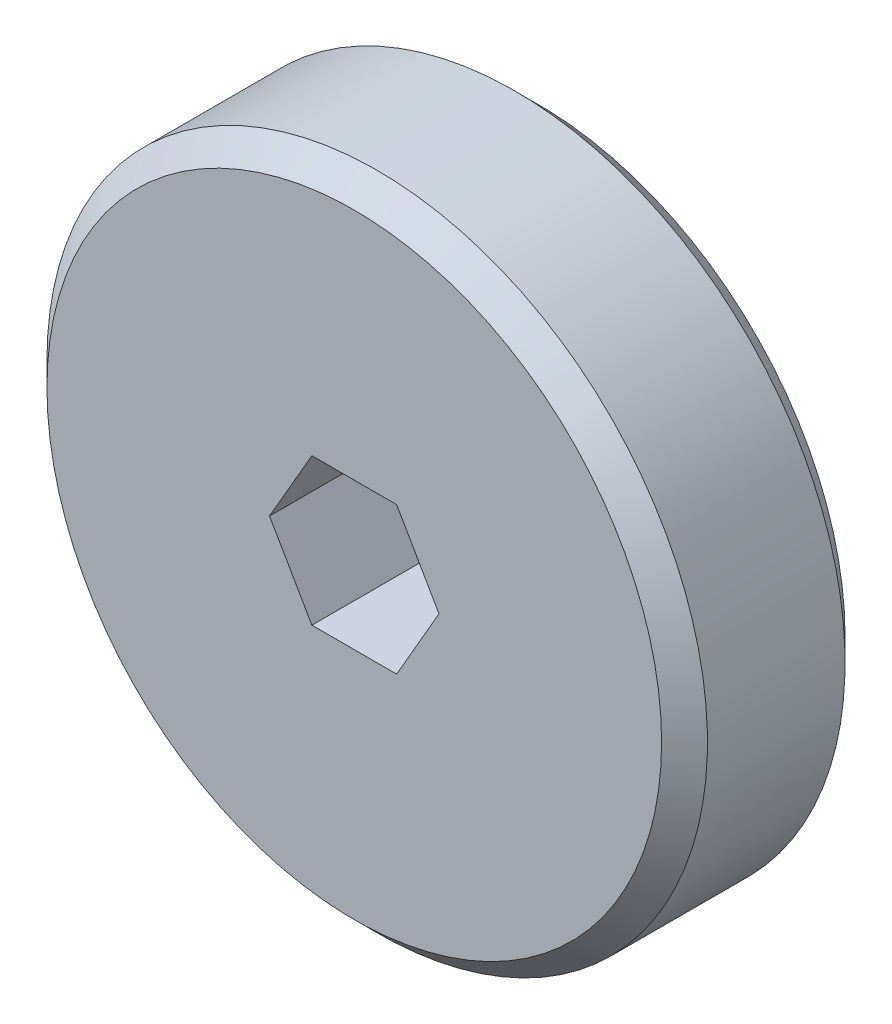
ISO-10303-21;
HEADER;
FILE_DESCRIPTION(('STEP AP214'),'2;1');
FILE_NAME('part.step','',(''),(''),'','','');
FILE_SCHEMA(('AUTOMOTIVE_DESIGN { 1 0 10303 214 1 1 1 1 }'));
ENDSEC;
DATA;
#1=APPLICATION_CONTEXT('core data for automotive mechanical design processes');
#2=APPLICATION_PROTOCOL_DEFINITION('international standard','automotive_design',2000,#1);
#3=PRODUCT_CONTEXT('',#1,'mechanical');
#4=PRODUCT('Part','Part','',(#3));
#5=PRODUCT_RELATED_PRODUCT_CATEGORY('part','',(#4));
#6=PRODUCT_DEFINITION_FORMATION('','',#4);
#7=PRODUCT_DEFINITION_CONTEXT('part definition',#1,'design');
#8=PRODUCT_DEFINITION('design','',#6,#7);
#9=PRODUCT_DEFINITION_SHAPE('','',#8);
#10=(LENGTH_UNIT() NAMED_UNIT(*) SI_UNIT(.MILLI.,.METRE.));
#11=(NAMED_UNIT(*) PLANE_ANGLE_UNIT() SI_UNIT($,.RADIAN.));
#12=(NAMED_UNIT(*) SI_UNIT($,.STERADIAN.) SOLID_ANGLE_UNIT());
#13=UNCERTAINTY_MEASURE_WITH_UNIT(LENGTH_MEASURE(1.E-05),#10,'distance_accuracy_value','');
#14=(GEOMETRIC_REPRESENTATION_CONTEXT(3) GLOBAL_UNCERTAINTY_ASSIGNED_CONTEXT((#13)) GLOBAL_UNIT_ASSIGNED_CONTEXT((#10,
#11,#12)) REPRESENTATION_CONTEXT('',''));
#15=CARTESIAN_POINT('',(0.,0.,0.));
#16=DIRECTION('',(0.,0.,1.));
#17=DIRECTION('',(1.,0.,0.));
#18=AXIS2_PLACEMENT_3D('',#15,#16,#17);
#19=CARTESIAN_POINT('',(0.,0.,0.));
#20=DIRECTION('',(0.,0.,1.));
#21=DIRECTION('',(1.,0.,0.));
#22=AXIS2_PLACEMENT_3D('',#19,#20,#21);
#23=PLANE('',#22);
#24=DIRECTION('',(-0.5,-0.866025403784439,0.));
#25=VECTOR('',#24,1.);
#26=CARTESIAN_POINT('',(3.66617420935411,0.,0.));
#27=LINE('',#26,#25);
#28=CARTESIAN_POINT('',(3.66617420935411,0.,0.));
#29=VERTEX_POINT('',#28);
#30=CARTESIAN_POINT('',(1.833087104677,-3.175,0.));
#31=VERTEX_POINT('',#30);
#32=EDGE_CURVE('E147',#29,#31,#27,.T.);
#33=ORIENTED_EDGE('',*,*,#32,.F.);
#34=DIRECTION('',(0.5,-0.866025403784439,0.));
#35=VECTOR('',#34,1.);
#36=CARTESIAN_POINT('',(1.833087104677,3.175,0.));
#37=LINE('',#36,#35);
#38=CARTESIAN_POINT('',(1.833087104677,3.175,0.));
#39=VERTEX_POINT('',#38);
#40=EDGE_CURVE('E66',#39,#29,#37,.T.);
#41=ORIENTED_EDGE('',*,*,#40,.F.);
#42=DIRECTION('',(1.,0.,0.));
#43=VECTOR('',#42,1.);
#44=CARTESIAN_POINT('',(-1.833087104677,3.175,0.));
#45=LINE('',#44,#43);
#46=CARTESIAN_POINT('',(-1.833087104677,3.175,0.));
#47=VERTEX_POINT('',#46);
#48=EDGE_CURVE('E126',#47,#39,#45,.T.);
#49=ORIENTED_EDGE('',*,*,#48,.F.);
#50=DIRECTION('',(0.5,0.866025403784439,0.));
#51=VECTOR('',#50,1.);
#52=CARTESIAN_POINT('',(-3.66617420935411,0.,0.));
#53=LINE('',#52,#51);
#54=CARTESIAN_POINT('',(-3.66617420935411,0.,0.));
#55=VERTEX_POINT('',#54);
#56=EDGE_CURVE('E131',#55,#47,#53,.T.);
#57=ORIENTED_EDGE('',*,*,#56,.F.);
#58=DIRECTION('',(-0.5,0.866025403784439,0.));
#59=VECTOR('',#58,1.);
#60=CARTESIAN_POINT('',(-1.833087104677,-3.175,0.));
#61=LINE('',#60,#59);
#62=CARTESIAN_POINT('',(-1.833087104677,-3.175,0.));
#63=VERTEX_POINT('',#62);
#64=EDGE_CURVE('E154',#63,#55,#61,.T.);
#65=ORIENTED_EDGE('',*,*,#64,.F.);
#66=DIRECTION('',(-1.,0.,0.));
#67=VECTOR('',#66,1.);
#68=CARTESIAN_POINT('',(1.833087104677,-3.175,0.));
#69=LINE('',#68,#67);
#70=EDGE_CURVE('E150',#31,#63,#69,.T.);
#71=ORIENTED_EDGE('',*,*,#70,.F.);
#72=EDGE_LOOP('',(#33,#41,#49,#57,#65,#71));
#73=FACE_BOUND('',#72,.T.);
#74=CARTESIAN_POINT('',(0.,0.,0.));
#75=DIRECTION('',(0.,0.,-1.));
#76=DIRECTION('',(-1.,0.,0.));
#77=AXIS2_PLACEMENT_3D('',#74,#75,#76);
#78=CIRCLE('',#77,13.29563);
#79=CARTESIAN_POINT('',(-13.29563,0.,0.));
#80=VERTEX_POINT('',#79);
#81=EDGE_CURVE('E11',#80,#80,#78,.T.);
#82=ORIENTED_EDGE('',*,*,#81,.T.);
#83=EDGE_LOOP('',(#82));
#84=FACE_BOUND('',#83,.T.);
#85=ADVANCED_FACE('F51',(#73,#84),#23,.F.);
#86=CARTESIAN_POINT('',(0.,0.,0.991869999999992));
#87=DIRECTION('',(0.,0.,1.));
#88=DIRECTION('',(1.,0.,0.));
#89=AXIS2_PLACEMENT_3D('',#86,#87,#88);
#90=CONICAL_SURFACE('',#89,14.2875,0.78539816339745);
#91=ORIENTED_EDGE('',*,*,#81,.F.);
#92=EDGE_LOOP('',(#91));
#93=FACE_BOUND('',#92,.T.);
#94=CARTESIAN_POINT('',(0.,0.,0.991869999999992));
#95=DIRECTION('',(0.,0.,-1.));
#96=DIRECTION('',(-1.,0.,0.));
#97=AXIS2_PLACEMENT_3D('',#94,#95,#96);
#98=CIRCLE('',#97,14.2875);
#99=CARTESIAN_POINT('',(-14.2875,0.,0.991869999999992));
#100=VERTEX_POINT('',#99);
#101=EDGE_CURVE('E59',#100,#100,#98,.T.);
#102=ORIENTED_EDGE('',*,*,#101,.T.);
#103=EDGE_LOOP('',(#102));
#104=FACE_BOUND('',#103,.T.);
#105=ADVANCED_FACE('F187',(#93,#104),#90,.T.);
#106=CARTESIAN_POINT('',(0.,0.,-10.585154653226));
#107=DIRECTION('',(0.,0.,-1.));
#108=DIRECTION('',(-1.,0.,0.));
#109=AXIS2_PLACEMENT_3D('',#106,#107,#108);
#110=CYLINDRICAL_SURFACE('',#109,14.2875);
#111=ORIENTED_EDGE('',*,*,#101,.F.);
#112=EDGE_LOOP('',(#111));
#113=FACE_BOUND('',#112,.T.);
#114=CARTESIAN_POINT('',(0.,0.,6.94562999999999));
#115=DIRECTION('',(0.,0.,-1.));
#116=DIRECTION('',(-1.,0.,0.));
#117=AXIS2_PLACEMENT_3D('',#114,#115,#116);
#118=CIRCLE('',#117,14.2875);
#119=CARTESIAN_POINT('',(-14.2875,0.,6.94562999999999));
#120=VERTEX_POINT('',#119);
#121=EDGE_CURVE('E179',#120,#120,#118,.T.);
#122=ORIENTED_EDGE('',*,*,#121,.T.);
#123=EDGE_LOOP('',(#122));
#124=FACE_BOUND('',#123,.T.);
#125=ADVANCED_FACE('F189',(#113,#124),#110,.T.);
#126=CARTESIAN_POINT('',(0.,0.,7.9375));
#127=DIRECTION('',(0.,0.,-1.));
#128=DIRECTION('',(-1.,0.,0.));
#129=AXIS2_PLACEMENT_3D('',#126,#127,#128);
#130=CONICAL_SURFACE('',#129,13.29563,0.785398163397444);
#131=ORIENTED_EDGE('',*,*,#121,.F.);
#132=EDGE_LOOP('',(#131));
#133=FACE_BOUND('',#132,.T.);
#134=CARTESIAN_POINT('',(0.,0.,7.9375));
#135=DIRECTION('',(0.,0.,-1.));
#136=DIRECTION('',(-1.,0.,0.));
#137=AXIS2_PLACEMENT_3D('',#134,#135,#136);
#138=CIRCLE('',#137,13.29563);
#139=CARTESIAN_POINT('',(-13.29563,0.,7.9375));
#140=VERTEX_POINT('',#139);
#141=EDGE_CURVE('E164',#140,#140,#138,.T.);
#142=ORIENTED_EDGE('',*,*,#141,.T.);
#143=EDGE_LOOP('',(#142));
#144=FACE_BOUND('',#143,.T.);
#145=ADVANCED_FACE('F192',(#133,#144),#130,.T.);
#146=CARTESIAN_POINT('',(-13.29563,0.,7.9375));
#147=DIRECTION('',(0.,0.,-1.));
#148=DIRECTION('',(-1.,0.,0.));
#149=AXIS2_PLACEMENT_3D('',#146,#147,#148);
#150=PLANE('',#149);
#151=DIRECTION('',(1.,0.,0.));
#152=VECTOR('',#151,1.);
#153=CARTESIAN_POINT('',(-1.833087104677,3.175,7.9375));
#154=LINE('',#153,#152);
#155=CARTESIAN_POINT('',(-1.833087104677,3.175,7.9375));
#156=VERTEX_POINT('',#155);
#157=CARTESIAN_POINT('',(1.833087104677,3.175,7.9375));
#158=VERTEX_POINT('',#157);
#159=EDGE_CURVE('E113',#156,#158,#154,.T.);
#160=ORIENTED_EDGE('',*,*,#159,.T.);
#161=DIRECTION('',(0.5,-0.866025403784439,0.));
#162=VECTOR('',#161,1.);
#163=CARTESIAN_POINT('',(1.833087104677,3.175,7.9375));
#164=LINE('',#163,#162);
#165=CARTESIAN_POINT('',(3.66617420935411,0.,7.9375));
#166=VERTEX_POINT('',#165);
#167=EDGE_CURVE('E106',#158,#166,#164,.T.);
#168=ORIENTED_EDGE('',*,*,#167,.T.);
#169=DIRECTION('',(-0.5,-0.866025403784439,0.));
#170=VECTOR('',#169,1.);
#171=CARTESIAN_POINT('',(3.66617420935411,0.,7.9375));
#172=LINE('',#171,#170);
#173=CARTESIAN_POINT('',(1.833087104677,-3.17500000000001,7.9375));
#174=VERTEX_POINT('',#173);
#175=EDGE_CURVE('E116',#166,#174,#172,.T.);
#176=ORIENTED_EDGE('',*,*,#175,.T.);
#177=DIRECTION('',(-1.,0.,0.));
#178=VECTOR('',#177,1.);
#179=CARTESIAN_POINT('',(1.833087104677,-3.17500000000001,7.9375));
#180=LINE('',#179,#178);
#181=CARTESIAN_POINT('',(-1.833087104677,-3.17500000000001,7.9375));
#182=VERTEX_POINT('',#181);
#183=EDGE_CURVE('E74',#174,#182,#180,.T.);
#184=ORIENTED_EDGE('',*,*,#183,.T.);
#185=DIRECTION('',(-0.5,0.866025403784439,0.));
#186=VECTOR('',#185,1.);
#187=CARTESIAN_POINT('',(-1.833087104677,-3.17500000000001,7.9375));
#188=LINE('',#187,#186);
#189=CARTESIAN_POINT('',(-3.66617420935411,0.,7.9375));
#190=VERTEX_POINT('',#189);
#191=EDGE_CURVE('E136',#182,#190,#188,.T.);
#192=ORIENTED_EDGE('',*,*,#191,.T.);
#193=DIRECTION('',(0.5,0.866025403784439,0.));
#194=VECTOR('',#193,1.);
#195=CARTESIAN_POINT('',(-3.66617420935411,0.,7.9375));
#196=LINE('',#195,#194);
#197=EDGE_CURVE('E140',#190,#156,#196,.T.);
#198=ORIENTED_EDGE('',*,*,#197,.T.);
#199=EDGE_LOOP('',(#160,#168,#176,#184,#192,#198));
#200=FACE_BOUND('',#199,.T.);
#201=ORIENTED_EDGE('',*,*,#141,.F.);
#202=EDGE_LOOP('',(#201));
#203=FACE_BOUND('',#202,.T.);
#204=ADVANCED_FACE('F121',(#200,#203),#150,.F.);
#205=CARTESIAN_POINT('',(1.833087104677,3.175,7.9375));
#206=DIRECTION('',(0.866025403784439,0.5,0.));
#207=DIRECTION('',(-0.5,0.866025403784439,0.));
#208=AXIS2_PLACEMENT_3D('',#205,#206,#207);
#209=PLANE('',#208);
#210=ORIENTED_EDGE('',*,*,#40,.T.);
#211=DIRECTION('',(0.,0.,-1.));
#212=VECTOR('',#211,1.);
#213=CARTESIAN_POINT('',(3.66617420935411,0.,7.9375));
#214=LINE('',#213,#212);
#215=EDGE_CURVE('E102',#166,#29,#214,.T.);
#216=ORIENTED_EDGE('',*,*,#215,.F.);
#217=ORIENTED_EDGE('',*,*,#167,.F.);
#218=DIRECTION('',(0.,0.,-1.));
#219=VECTOR('',#218,1.);
#220=CARTESIAN_POINT('',(1.833087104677,3.175,7.9375));
#221=LINE('',#220,#219);
#222=EDGE_CURVE('E161',#158,#39,#221,.T.);
#223=ORIENTED_EDGE('',*,*,#222,.T.);
#224=EDGE_LOOP('',(#210,#216,#217,#223));
#225=FACE_BOUND('',#224,.T.);
#226=ADVANCED_FACE('F104',(#225),#209,.F.);
#227=CARTESIAN_POINT('',(-1.833087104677,3.175,7.9375));
#228=DIRECTION('',(0.,1.,0.));
#229=DIRECTION('',(-1.,0.,0.));
#230=AXIS2_PLACEMENT_3D('',#227,#228,#229);
#231=PLANE('',#230);
#232=ORIENTED_EDGE('',*,*,#48,.T.);
#233=ORIENTED_EDGE('',*,*,#222,.F.);
#234=ORIENTED_EDGE('',*,*,#159,.F.);
#235=DIRECTION('',(0.,0.,-1.));
#236=VECTOR('',#235,1.);
#237=CARTESIAN_POINT('',(-1.833087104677,3.175,7.9375));
#238=LINE('',#237,#236);
#239=EDGE_CURVE('E165',#156,#47,#238,.T.);
#240=ORIENTED_EDGE('',*,*,#239,.T.);
#241=EDGE_LOOP('',(#232,#233,#234,#240));
#242=FACE_BOUND('',#241,.T.);
#243=ADVANCED_FACE('F206',(#242),#231,.F.);
#244=CARTESIAN_POINT('',(-3.66617420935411,0.,7.9375));
#245=DIRECTION('',(-0.866025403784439,0.5,0.));
#246=DIRECTION('',(-0.5,-0.866025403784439,0.));
#247=AXIS2_PLACEMENT_3D('',#244,#245,#246);
#248=PLANE('',#247);
#249=ORIENTED_EDGE('',*,*,#56,.T.);
#250=ORIENTED_EDGE('',*,*,#239,.F.);
#251=ORIENTED_EDGE('',*,*,#197,.F.);
#252=DIRECTION('',(0.,0.,-1.));
#253=VECTOR('',#252,1.);
#254=CARTESIAN_POINT('',(-3.66617420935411,0.,7.9375));
#255=LINE('',#254,#253);
#256=EDGE_CURVE('E168',#190,#55,#255,.T.);
#257=ORIENTED_EDGE('',*,*,#256,.T.);
#258=EDGE_LOOP('',(#249,#250,#251,#257));
#259=FACE_BOUND('',#258,.T.);
#260=ADVANCED_FACE('F227',(#259),#248,.F.);
#261=CARTESIAN_POINT('',(-1.833087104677,-3.17500000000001,7.9375));
#262=DIRECTION('',(-0.866025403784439,-0.5,0.));
#263=DIRECTION('',(0.5,-0.866025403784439,0.));
#264=AXIS2_PLACEMENT_3D('',#261,#262,#263);
#265=PLANE('',#264);
#266=ORIENTED_EDGE('',*,*,#64,.T.);
#267=ORIENTED_EDGE('',*,*,#256,.F.);
#268=ORIENTED_EDGE('',*,*,#191,.F.);
#269=DIRECTION('',(0.,0.,-1.));
#270=VECTOR('',#269,1.);
#271=CARTESIAN_POINT('',(-1.833087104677,-3.17500000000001,7.9375));
#272=LINE('',#271,#270);
#273=EDGE_CURVE('E171',#182,#63,#272,.T.);
#274=ORIENTED_EDGE('',*,*,#273,.T.);
#275=EDGE_LOOP('',(#266,#267,#268,#274));
#276=FACE_BOUND('',#275,.T.);
#277=ADVANCED_FACE('F224',(#276),#265,.F.);
#278=CARTESIAN_POINT('',(1.833087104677,-3.17500000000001,7.9375));
#279=DIRECTION('',(0.,-1.,0.));
#280=DIRECTION('',(1.,0.,0.));
#281=AXIS2_PLACEMENT_3D('',#278,#279,#280);
#282=PLANE('',#281);
#283=ORIENTED_EDGE('',*,*,#70,.T.);
#284=ORIENTED_EDGE('',*,*,#273,.F.);
#285=ORIENTED_EDGE('',*,*,#183,.F.);
#286=DIRECTION('',(0.,0.,-1.));
#287=VECTOR('',#286,1.);
#288=CARTESIAN_POINT('',(1.833087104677,-3.17500000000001,7.9375));
#289=LINE('',#288,#287);
#290=EDGE_CURVE('E112',#174,#31,#289,.T.);
#291=ORIENTED_EDGE('',*,*,#290,.T.);
#292=EDGE_LOOP('',(#283,#284,#285,#291));
#293=FACE_BOUND('',#292,.T.);
#294=ADVANCED_FACE('F221',(#293),#282,.F.);
#295=CARTESIAN_POINT('',(3.66617420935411,0.,7.9375));
#296=DIRECTION('',(0.866025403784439,-0.5,0.));
#297=DIRECTION('',(0.5,0.866025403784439,0.));
#298=AXIS2_PLACEMENT_3D('',#295,#296,#297);
#299=PLANE('',#298);
#300=ORIENTED_EDGE('',*,*,#32,.T.);
#301=ORIENTED_EDGE('',*,*,#290,.F.);
#302=ORIENTED_EDGE('',*,*,#175,.F.);
#303=ORIENTED_EDGE('',*,*,#215,.T.);
#304=EDGE_LOOP('',(#300,#301,#302,#303));
#305=FACE_BOUND('',#304,.T.);
#306=ADVANCED_FACE('F117',(#305),#299,.F.);
#307=CLOSED_SHELL('',(#85,#105,#125,#145,#204,#226,#243,#260,#277,#294,#306));
#308=MANIFOLD_SOLID_BREP('B2',#307);
#309=ADVANCED_BREP_SHAPE_REPRESENTATION('',(#18,#308),#14);
#310=SHAPE_DEFINITION_REPRESENTATION(#9,#309);
ENDSEC;
END-ISO-10303-21;
